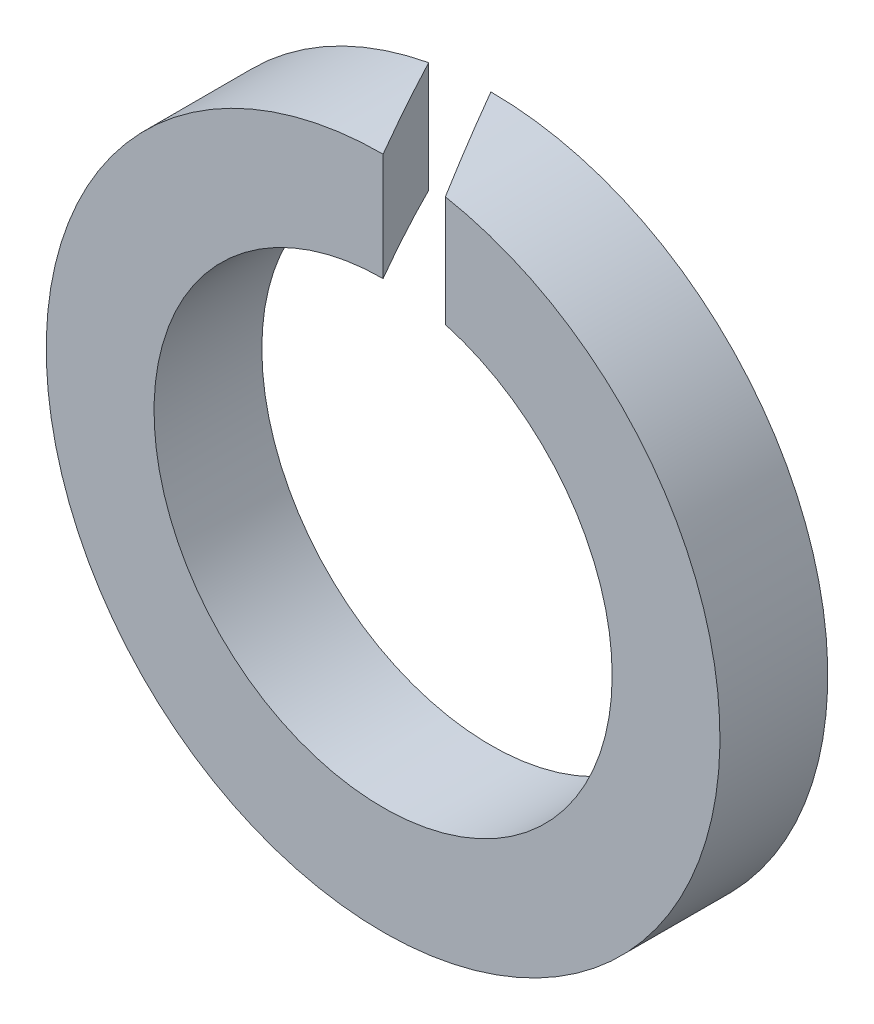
from build123d import *

# Parameters (mm, degrees)
SKETCH1_R          = 2.5
SKETCH1_R_2        = 1.7
BASE_EXTRUDE_DEPTH = 0.8
CUT_EXTRUDE1_DEPTH = 4.624913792


with BuildPart() as part:
    # Sketch1 → Base-Extrude (new body)
    with BuildSketch(Plane.XY):
        Circle(SKETCH1_R)
        Circle(SKETCH1_R_2, mode=Mode.SUBTRACT)
    extrude(amount=-BASE_EXTRUDE_DEPTH)

    # Sketch2 → Cut-Extrude1 (cut, through all)
    with BuildSketch(Plane(origin=(0, 0, 0), x_dir=(1, 0, 0), z_dir=(0, 1, 0))):
        Polygon((0, 0.8), (0.461880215, 0), (0, 0), (-0.461880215, 0.8), align=None)
    extrude(amount=CUT_EXTRUDE1_DEPTH, mode=Mode.SUBTRACT)


solid = part.part
